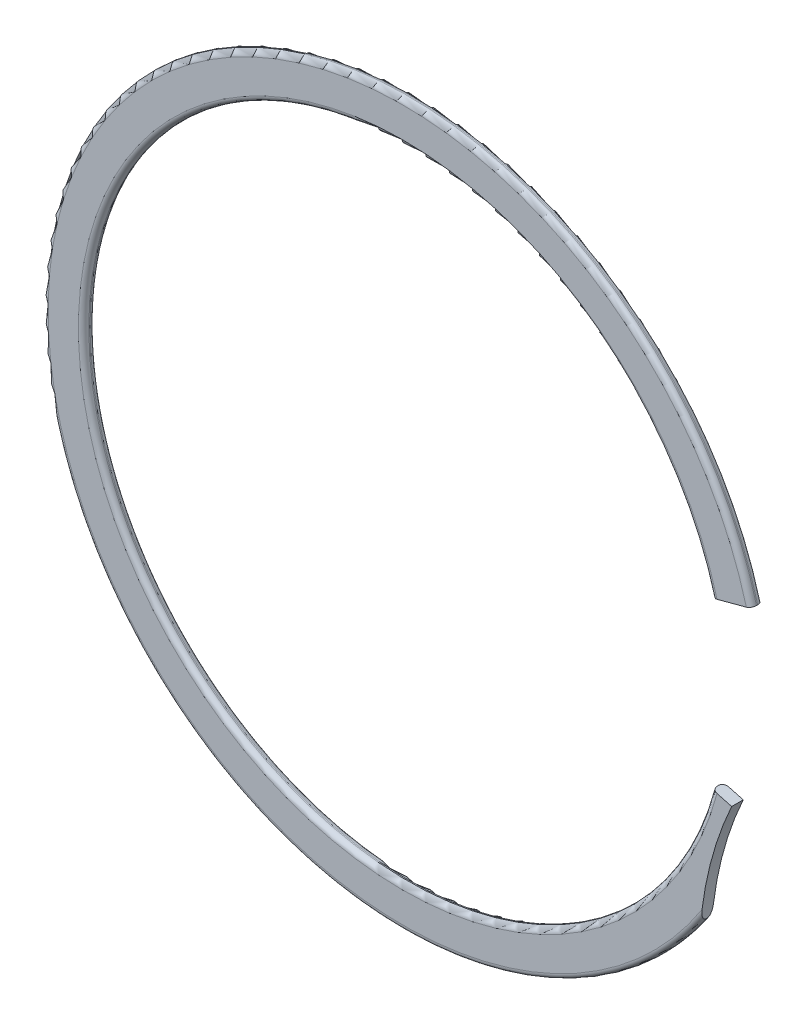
from build123d import *

# Parameters (mm, degrees)
EXTRUDE1_DEPTH = 0.3175
FILLET1_R      = 0.28575


with BuildPart() as part:
    # Sketch2 → Extrude1 (new, symmetric)
    with BuildSketch(Plane.XY):
        with BuildLine():
            Line((16.965617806, -4.54592359), (18.045136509, -4.835179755))
            ThreePointArc((18.045136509, -4.835179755), (16.928530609, -7.930617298), (16.347820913, -11.169647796))
            ThreePointArc((16.347820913, -11.169647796), (-19.517900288, 3.326236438), (19.124655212, 5.12443592))
            Line((19.124655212, 5.12443592), (16.965617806, 4.54592359))
            ThreePointArc((16.965617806, 4.54592359), (-17.5641, 0), (16.965617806, -4.54592359))
        make_face()
    extrude(amount=EXTRUDE1_DEPTH, both=True)

    # Fillet1
    fillet1_edges = [part.edges().sort_by_distance(p)[0] for p in [
        (-19.517900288, 3.326236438, 0.3175),
        (-17.5641, 0, 0.3175),
        (-19.517900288, 3.326236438, -0.3175),
        (-17.5641, 0, -0.3175),
    ]]
    fillet(fillet1_edges, radius=FILLET1_R)


solid = part.part
